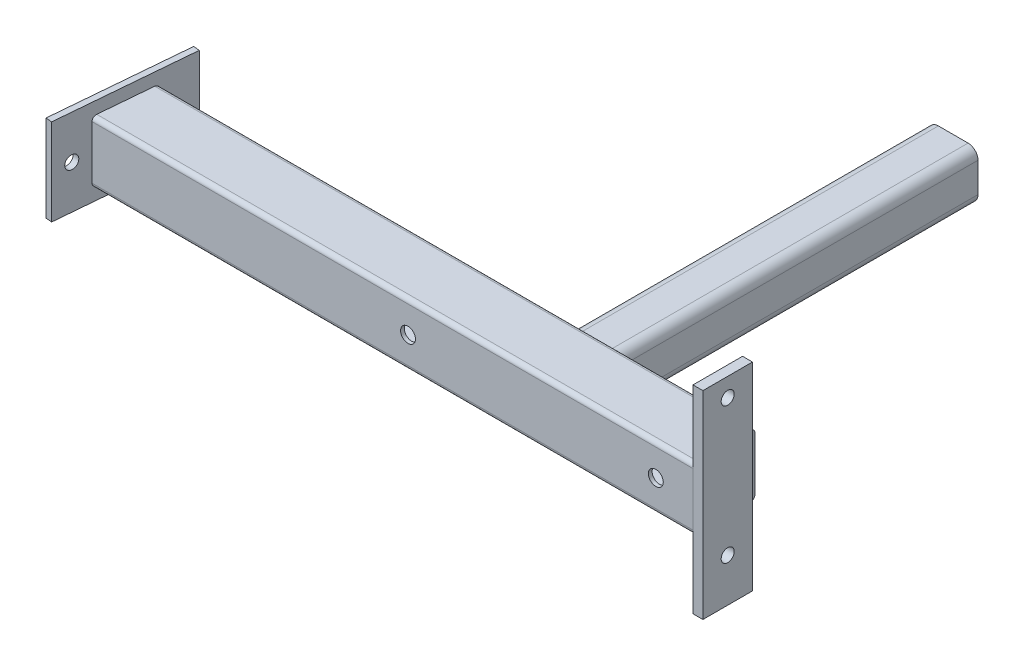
from build123d import *

# Parameters (mm, degrees)
EL_MENT_M_CANO_SOUD_2_DEPTH = 485
ESQUISSE8_R                 = 6
ENL_V_MAT_EXTRU_2_DEPTH     = 360.374456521
ESQUISSE4_W                 = 153.163472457
ESQUISSE4_H                 = 153.163472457
ENL_V_MAT_EXTRU_1_DEPTH     = 484.991190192
EL_MENT_M_CANO_SOUD_3_DEPTH = 290
ESQUISSE7_W                 = 40
ESQUISSE7_H                 = 160
ESQUISSE7_R                 = 5.25
BOSS_EXTRU_1_DEPTH          = 8
ESQUISSE9_W                 = 110
ESQUISSE9_H                 = 70
ESQUISSE9_R                 = 5.25
BOSS_EXTRU_2_DEPTH          = 5


with BuildPart() as part:
    # Sketch12 → El_ment m_cano-soud_2 (new body)
    with BuildSketch(Plane(origin=(-355, 0, 0), x_dir=(0, 0, -1), z_dir=(1, 0, 0))):
        with BuildLine():
            Line((-21.5, -25), (21.5, -25))
            ThreePointArc((21.5, -25), (23.974873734, -23.974873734), (25, -21.5))
            Line((25, -21.5), (25, 21.5))
            ThreePointArc((25, 21.5), (23.974873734, 23.974873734), (21.5, 25))
            Line((21.5, 25), (-21.5, 25))
            ThreePointArc((-21.5, 25), (-23.974873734, 23.974873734), (-25, 21.5))
            Line((-25, 21.5), (-25, -21.5))
            ThreePointArc((-25, -21.5), (-23.974873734, -23.974873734), (-21.5, -25))
        make_face()
        with BuildLine():
            Line((-21.5, -22), (21.5, -22))
            ThreePointArc((21.5, -22), (21.853553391, -21.853553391), (22, -21.5))
            Line((22, -21.5), (22, 21.5))
            ThreePointArc((22, 21.5), (21.853553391, 21.853553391), (21.5, 22))
            Line((21.5, 22), (-21.5, 22))
            ThreePointArc((-21.5, 22), (-21.853553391, 21.853553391), (-22, 21.5))
            Line((-22, 21.5), (-22, -21.5))
            ThreePointArc((-22, -21.5), (-21.853553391, -21.853553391), (-21.5, -22))
        make_face(mode=Mode.SUBTRACT)
    extrude(amount=EL_MENT_M_CANO_SOUD_2_DEPTH)

    # Esquisse8 → Enl_v. mat.-Extru.2 (cut, through all)
    with BuildSketch(Plane(origin=(0, 0, -25), x_dir=(-1, 0, 0), z_dir=(0, 0, -1))):
        with Locations((-100, 0)):
            Circle(ESQUISSE8_R)
        with Locations((100, 0)):
            Circle(ESQUISSE8_R)
    extrude(amount=-ENL_V_MAT_EXTRU_2_DEPTH, mode=Mode.SUBTRACT)

    # Esquisse4 → Enl_v. mat.-Extru.1 (cut, through all)
    with BuildSketch(Plane(origin=(-350.132773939, 0, -30.632648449), x_dir=(-0.08715574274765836, 0, 0.9961946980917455), z_dir=(-0.9961946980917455, 0, -0.08715574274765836))):
        with Locations((24.068184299, -20.399851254)):
            Rectangle(ESQUISSE4_W, ESQUISSE4_H)
    extrude(amount=ENL_V_MAT_EXTRU_1_DEPTH, mode=Mode.SUBTRACT)


with BuildPart() as body_2:
    # Sketch1 → El_ment m_cano-soud_3 (new body)
    with BuildSketch(Plane(origin=(0, 0, -25), x_dir=(1, 0, 0), z_dir=(0, 0, -1))):
        with BuildLine():
            Line((-12, -20), (12, -20))
            ThreePointArc((12, -20), (17.656854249, -17.656854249), (20, -12))
            Line((20, -12), (20, 12))
            ThreePointArc((20, 12), (17.656854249, 17.656854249), (12, 20))
            Line((12, 20), (-12, 20))
            ThreePointArc((-12, 20), (-17.656854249, 17.656854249), (-20, 12))
            Line((-20, 12), (-20, -12))
            ThreePointArc((-20, -12), (-17.656854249, -17.656854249), (-12, -20))
        make_face()
        with BuildLine():
            Line((-12, -16), (12, -16))
            ThreePointArc((12, -16), (14.828427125, -14.828427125), (16, -12))
            Line((16, -12), (16, 12))
            ThreePointArc((16, 12), (14.828427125, 14.828427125), (12, 16))
            Line((12, 16), (-12, 16))
            ThreePointArc((-12, 16), (-14.828427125, 14.828427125), (-16, 12))
            Line((-16, 12), (-16, -12))
            ThreePointArc((-16, -12), (-14.828427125, -14.828427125), (-12, -16))
        make_face(mode=Mode.SUBTRACT)
    extrude(amount=EL_MENT_M_CANO_SOUD_3_DEPTH)


with BuildPart() as body_3:
    # Esquisse7 → Boss.-Extru.1 (new body)
    with BuildSketch(Plane(origin=(130, 0, 0), x_dir=(0, 0, -1), z_dir=(1, 0, 0))):
        with Locations((-5, 0)):
            Rectangle(ESQUISSE7_W, ESQUISSE7_H)
        with Locations((-5, 65)):
            Circle(ESQUISSE7_R, mode=Mode.SUBTRACT)
        with Locations((-5, -45)):
            Circle(ESQUISSE7_R, mode=Mode.SUBTRACT)
    extrude(amount=BOSS_EXTRU_1_DEPTH)


with BuildPart() as body_4:
    # Esquisse9 → Boss.-Extru.2 (new body)
    with BuildSketch(Plane(origin=(-350.132773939, 0, -30.632648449), x_dir=(-0.08715574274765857, 0, 0.9961946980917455), z_dir=(-0.9961946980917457, 0, -0.08715574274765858))):
        with Locations((30.940288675, 0)):
            Rectangle(ESQUISSE9_W, ESQUISSE9_H)
        with Locations((-9.059711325, 0)):
            Circle(ESQUISSE9_R, mode=Mode.SUBTRACT)
        with Locations((70.940288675, 0)):
            Circle(ESQUISSE9_R, mode=Mode.SUBTRACT)
    extrude(amount=BOSS_EXTRU_2_DEPTH)


solid = Compound([part.part, body_2.part, body_3.part, body_4.part])
